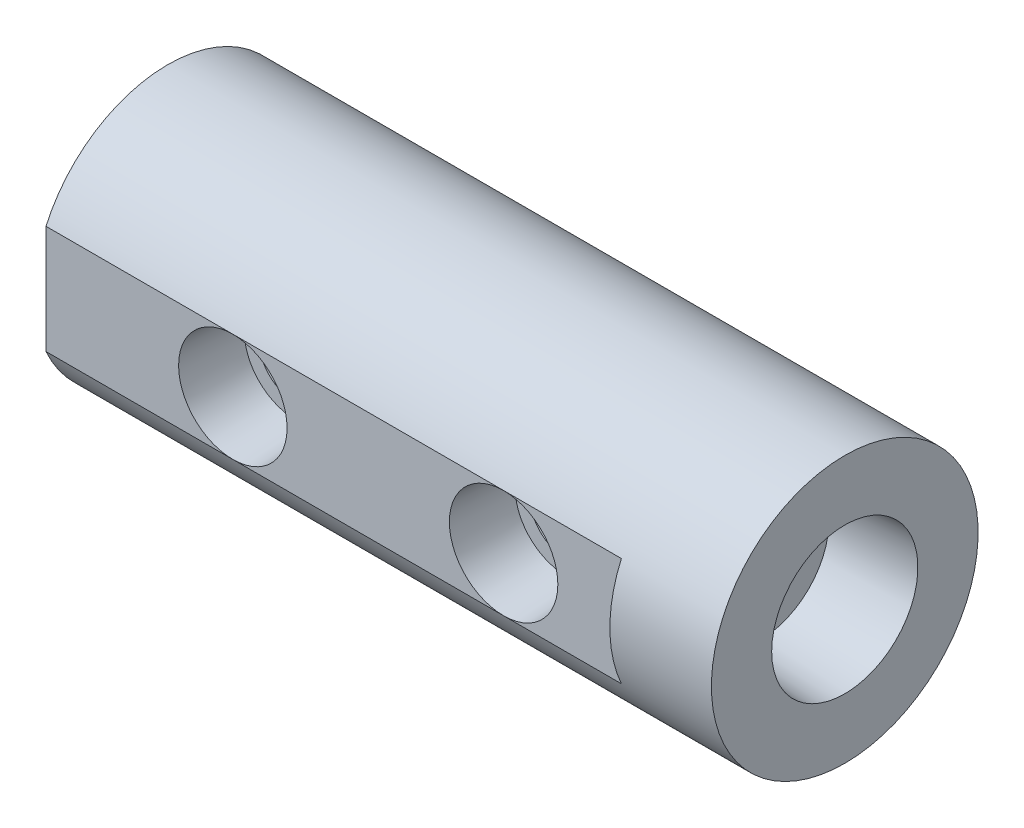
ISO-10303-21;
HEADER;
FILE_DESCRIPTION(('STEP AP214'),'2;1');
FILE_NAME('part.step','',(''),(''),'','','');
FILE_SCHEMA(('AUTOMOTIVE_DESIGN { 1 0 10303 214 1 1 1 1 }'));
ENDSEC;
DATA;
#1=APPLICATION_CONTEXT('core data for automotive mechanical design processes');
#2=APPLICATION_PROTOCOL_DEFINITION('international standard','automotive_design',2000,#1);
#3=PRODUCT_CONTEXT('',#1,'mechanical');
#4=PRODUCT('Part','Part','',(#3));
#5=PRODUCT_RELATED_PRODUCT_CATEGORY('part','',(#4));
#6=PRODUCT_DEFINITION_FORMATION('','',#4);
#7=PRODUCT_DEFINITION_CONTEXT('part definition',#1,'design');
#8=PRODUCT_DEFINITION('design','',#6,#7);
#9=PRODUCT_DEFINITION_SHAPE('','',#8);
#10=(LENGTH_UNIT() NAMED_UNIT(*) SI_UNIT(.MILLI.,.METRE.));
#11=(NAMED_UNIT(*) PLANE_ANGLE_UNIT() SI_UNIT($,.RADIAN.));
#12=(NAMED_UNIT(*) SI_UNIT($,.STERADIAN.) SOLID_ANGLE_UNIT());
#13=UNCERTAINTY_MEASURE_WITH_UNIT(LENGTH_MEASURE(1.E-05),#10,'distance_accuracy_value','');
#14=(GEOMETRIC_REPRESENTATION_CONTEXT(3) GLOBAL_UNCERTAINTY_ASSIGNED_CONTEXT((#13)) GLOBAL_UNIT_ASSIGNED_CONTEXT((#10,
#11,#12)) REPRESENTATION_CONTEXT('',''));
#15=CARTESIAN_POINT('',(0.,0.,0.));
#16=DIRECTION('',(0.,0.,1.));
#17=DIRECTION('',(1.,0.,0.));
#18=AXIS2_PLACEMENT_3D('',#15,#16,#17);
#19=CARTESIAN_POINT('',(17.526,0.,18.0848));
#20=DIRECTION('',(0.,0.,-1.));
#21=DIRECTION('',(-1.,0.,0.));
#22=AXIS2_PLACEMENT_3D('',#19,#20,#21);
#23=CYLINDRICAL_SURFACE('',#22,3.4163);
#24=CARTESIAN_POINT('',(17.526,0.,18.0848));
#25=DIRECTION('',(0.,0.,-1.));
#26=DIRECTION('',(-1.,0.,0.));
#27=AXIS2_PLACEMENT_3D('',#24,#25,#26);
#28=CIRCLE('',#27,3.4163);
#29=CARTESIAN_POINT('',(14.1097,0.,18.0848));
#30=VERTEX_POINT('',#29);
#31=EDGE_CURVE('E220',#30,#30,#28,.T.);
#32=ORIENTED_EDGE('',*,*,#31,.F.);
#33=EDGE_LOOP('',(#32));
#34=FACE_BOUND('',#33,.T.);
#35=CARTESIAN_POINT('',(17.526,0.,6.36660172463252));
#36=DIRECTION('',(0.,0.,-1.));
#37=DIRECTION('',(-1.,0.,0.));
#38=AXIS2_PLACEMENT_3D('',#35,#36,#37);
#39=CIRCLE('',#38,3.4163);
#40=CARTESIAN_POINT('',(14.1097,0.,6.36660172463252));
#41=VERTEX_POINT('',#40);
#42=EDGE_CURVE('E224',#41,#41,#39,.T.);
#43=ORIENTED_EDGE('',*,*,#42,.T.);
#44=EDGE_LOOP('',(#43));
#45=FACE_BOUND('',#44,.T.);
#46=CARTESIAN_POINT('',(20.9423,0.,15.4305));
#47=CARTESIAN_POINT('',(20.942290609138,-0.13763012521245,15.4304904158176));
#48=CARTESIAN_POINT('',(20.9339070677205,-0.275342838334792,15.4206974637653));
#49=CARTESIAN_POINT('',(20.9011248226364,-0.546180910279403,15.3822512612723));
#50=CARTESIAN_POINT('',(20.8767090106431,-0.679301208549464,15.3535778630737));
#51=CARTESIAN_POINT('',(20.8141180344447,-0.936371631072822,15.2795619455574));
#52=CARTESIAN_POINT('',(20.7760286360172,-1.06037323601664,15.2343232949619));
#53=CARTESIAN_POINT('',(20.6887053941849,-1.29786022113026,15.1295526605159));
#54=CARTESIAN_POINT('',(20.6394681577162,-1.41134238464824,15.070016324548));
#55=CARTESIAN_POINT('',(20.5123091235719,-1.66748912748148,14.9140660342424));
#56=CARTESIAN_POINT('',(20.4305827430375,-1.80495022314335,14.8122219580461));
#57=CARTESIAN_POINT('',(20.2576382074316,-2.05735949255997,14.589873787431));
#58=CARTESIAN_POINT('',(20.1663947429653,-2.17224516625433,14.4693194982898));
#59=CARTESIAN_POINT('',(20.0267919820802,-2.32855611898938,14.2750435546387));
#60=CARTESIAN_POINT('',(19.9793082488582,-2.37840870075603,14.2072902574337));
#61=CARTESIAN_POINT('',(19.8847230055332,-2.47223846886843,14.0675024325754));
#62=CARTESIAN_POINT('',(19.837621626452,-2.51621371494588,13.995466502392));
#63=CARTESIAN_POINT('',(19.7452083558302,-2.59808022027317,13.8471768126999));
#64=CARTESIAN_POINT('',(19.6998928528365,-2.63598428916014,13.7709324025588));
#65=CARTESIAN_POINT('',(19.6126669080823,-2.70555605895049,13.6138466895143));
#66=CARTESIAN_POINT('',(19.570753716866,-2.73722882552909,13.5330091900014));
#67=CARTESIAN_POINT('',(19.490291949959,-2.79558088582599,13.3613595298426));
#68=CARTESIAN_POINT('',(19.4520901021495,-2.8218528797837,13.2702401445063));
#69=CARTESIAN_POINT('',(19.3859571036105,-2.86587683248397,13.0824370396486));
#70=CARTESIAN_POINT('',(19.3580044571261,-2.88364664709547,12.9857654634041));
#71=CARTESIAN_POINT('',(19.3165231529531,-2.90960094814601,12.7863926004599));
#72=CARTESIAN_POINT('',(19.3032131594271,-2.91764029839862,12.683623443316));
#73=CARTESIAN_POINT('',(19.2949884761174,-2.92264023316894,12.4771064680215));
#74=CARTESIAN_POINT('',(19.3000564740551,-2.91961124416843,12.3733596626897));
#75=CARTESIAN_POINT('',(19.3251412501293,-2.90419341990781,12.1846802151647));
#76=CARTESIAN_POINT('',(19.3427797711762,-2.8932903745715,12.0992763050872));
#77=CARTESIAN_POINT('',(19.3876359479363,-2.86463291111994,11.9321592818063));
#78=CARTESIAN_POINT('',(19.4148699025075,-2.84686683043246,11.8504527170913));
#79=CARTESIAN_POINT('',(19.4734793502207,-2.80705729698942,11.6981209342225));
#80=CARTESIAN_POINT('',(19.5043021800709,-2.78550899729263,11.6271453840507));
#81=CARTESIAN_POINT('',(19.5698585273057,-2.73777318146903,11.4886158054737));
#82=CARTESIAN_POINT('',(19.6045950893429,-2.71158204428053,11.4210645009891));
#83=CARTESIAN_POINT('',(19.7126787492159,-2.62638732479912,11.2230068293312));
#84=CARTESIAN_POINT('',(19.7897929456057,-2.56083025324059,11.097346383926));
#85=CARTESIAN_POINT('',(19.9526457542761,-2.407498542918,10.8484151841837));
#86=CARTESIAN_POINT('',(20.0385843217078,-2.3183775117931,10.7261181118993));
#87=CARTESIAN_POINT('',(20.207185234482,-2.1211247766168,10.4955428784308));
#88=CARTESIAN_POINT('',(20.2898513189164,-2.0130155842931,10.3872483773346));
#89=CARTESIAN_POINT('',(20.4420388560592,-1.7847920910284,10.1926400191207));
#90=CARTESIAN_POINT('',(20.5120552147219,-1.66581804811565,10.1053863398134));
#91=CARTESIAN_POINT('',(20.6403703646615,-1.41139345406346,9.94775688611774));
#92=CARTESIAN_POINT('',(20.6986804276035,-1.27595895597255,9.8773648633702));
#93=CARTESIAN_POINT('',(20.7903111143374,-1.01538344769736,9.76767594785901));
#94=CARTESIAN_POINT('',(20.8262130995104,-0.892540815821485,9.72510166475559));
#95=CARTESIAN_POINT('',(20.8844633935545,-0.639271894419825,9.65630009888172));
#96=CARTESIAN_POINT('',(20.9068215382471,-0.508851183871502,9.63006095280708));
#97=CARTESIAN_POINT('',(20.9362505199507,-0.243321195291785,9.59556343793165));
#98=CARTESIAN_POINT('',(20.9432540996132,-0.108193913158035,9.587384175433));
#99=CARTESIAN_POINT('',(20.9411358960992,0.161763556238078,9.58986143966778));
#100=CARTESIAN_POINT('',(20.9320143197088,0.296593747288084,9.60051772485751));
#101=CARTESIAN_POINT('',(20.8996538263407,0.55229063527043,9.63847860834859));
#102=CARTESIAN_POINT('',(20.8774444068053,0.673475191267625,9.66456962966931));
#103=CARTESIAN_POINT('',(20.8213651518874,0.909037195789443,9.73085334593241));
#104=CARTESIAN_POINT('',(20.7874935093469,1.02341358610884,9.77104822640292));
#105=CARTESIAN_POINT('',(20.7068056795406,1.25283364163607,9.86763898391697));
#106=CARTESIAN_POINT('',(20.6591374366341,1.36711677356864,9.92511696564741));
#107=CARTESIAN_POINT('',(20.5551148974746,1.58433524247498,10.0522667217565));
#108=CARTESIAN_POINT('',(20.498753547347,1.68726124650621,10.1219484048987));
#109=CARTESIAN_POINT('',(20.3499835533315,1.93012400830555,10.3093186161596));
#110=CARTESIAN_POINT('',(20.2536806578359,2.062708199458,10.433548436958));
#111=CARTESIAN_POINT('',(20.1052534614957,2.24156498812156,10.6344802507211));
#112=CARTESIAN_POINT('',(20.0550350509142,2.29791871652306,10.7040072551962));
#113=CARTESIAN_POINT('',(19.9544492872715,2.4039715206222,10.8478336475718));
#114=CARTESIAN_POINT('',(19.9040819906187,2.45367285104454,10.9221314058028));
#115=CARTESIAN_POINT('',(19.7791856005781,2.56996413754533,11.1145643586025));
#116=CARTESIAN_POINT('',(19.7053669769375,2.63232397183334,11.2358110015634));
#117=CARTESIAN_POINT('',(19.6018017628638,2.71368799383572,11.4265039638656));
#118=CARTESIAN_POINT('',(19.5685005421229,2.73876295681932,11.491476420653));
#119=CARTESIAN_POINT('',(19.5055147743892,2.78462509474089,11.6245920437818));
#120=CARTESIAN_POINT('',(19.4758281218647,2.80541477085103,11.6927333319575));
#121=CARTESIAN_POINT('',(19.4148033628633,2.84696514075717,11.849821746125));
#122=CARTESIAN_POINT('',(19.3849129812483,2.86641514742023,11.9397062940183));
#123=CARTESIAN_POINT('',(19.3370051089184,2.89692797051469,12.1238669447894));
#124=CARTESIAN_POINT('',(19.318957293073,2.90801222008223,12.2181311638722));
#125=CARTESIAN_POINT('',(19.29790452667,2.92089706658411,12.409997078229));
#126=CARTESIAN_POINT('',(19.2950457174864,2.92260747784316,12.5076221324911));
#127=CARTESIAN_POINT('',(19.3054312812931,2.9162908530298,12.7017205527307));
#128=CARTESIAN_POINT('',(19.3186926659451,2.90825353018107,12.7981925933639));
#129=CARTESIAN_POINT('',(19.3626084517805,2.88075399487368,13.0061349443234));
#130=CARTESIAN_POINT('',(19.396245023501,2.85930518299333,13.1166786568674));
#131=CARTESIAN_POINT('',(19.4760871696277,2.80545293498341,13.3304249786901));
#132=CARTESIAN_POINT('',(19.5223371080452,2.77301073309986,13.4336000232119));
#133=CARTESIAN_POINT('',(19.6135813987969,2.70477474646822,13.6159549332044));
#134=CARTESIAN_POINT('',(19.6574862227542,2.67045479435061,13.6962576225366));
#135=CARTESIAN_POINT('',(19.7481203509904,2.5955239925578,13.8522544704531));
#136=CARTESIAN_POINT('',(19.7948513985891,2.55490923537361,13.927945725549));
#137=CARTESIAN_POINT('',(19.8895794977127,2.46754103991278,14.0750042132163));
#138=CARTESIAN_POINT('',(19.9375779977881,2.42078031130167,14.146366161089));
#139=CARTESIAN_POINT('',(20.0335659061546,2.32120724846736,14.2847472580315));
#140=CARTESIAN_POINT('',(20.0815553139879,2.26839466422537,14.3517662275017));
#141=CARTESIAN_POINT('',(20.1786206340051,2.15419924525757,14.4842537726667));
#142=CARTESIAN_POINT('',(20.2276489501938,2.09253851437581,14.5495184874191));
#143=CARTESIAN_POINT('',(20.3235068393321,1.9625457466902,14.6748656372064));
#144=CARTESIAN_POINT('',(20.370335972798,1.89421238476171,14.7349470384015));
#145=CARTESIAN_POINT('',(20.460620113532,1.75107078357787,14.8492336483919));
#146=CARTESIAN_POINT('',(20.5040836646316,1.67628003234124,14.9034538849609));
#147=CARTESIAN_POINT('',(20.5866917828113,1.5202202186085,15.0054694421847));
#148=CARTESIAN_POINT('',(20.6258369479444,1.4389520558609,15.0532656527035));
#149=CARTESIAN_POINT('',(20.7121410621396,1.23911359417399,15.1578579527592));
#150=CARTESIAN_POINT('',(20.7569501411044,1.1178193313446,15.2114960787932));
#151=CARTESIAN_POINT('',(20.8334640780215,0.865501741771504,15.3025382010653));
#152=CARTESIAN_POINT('',(20.865191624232,0.734495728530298,15.3399703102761));
#153=CARTESIAN_POINT('',(20.906590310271,0.502566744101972,15.3886732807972));
#154=CARTESIAN_POINT('',(20.9199180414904,0.403193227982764,15.4042961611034));
#155=CARTESIAN_POINT('',(20.9377769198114,0.20256155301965,15.4252137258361));
#156=CARTESIAN_POINT('',(20.9423069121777,0.10130314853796,15.4305070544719));
#157=CARTESIAN_POINT('',(20.9423,0.,15.4305));
#158=B_SPLINE_CURVE_WITH_KNOTS('',3,(#46,#47,#48,#49,#50,#51,#52,#53,#54,#55,#56,#57,#58,#59,
#60,#61,#62,#63,#64,#65,#66,#67,#68,#69,#70,#71,#72,#73,#74,#75,#76,#77,#78,#79,#80,#81,#82,#83,
#84,#85,#86,#87,#88,#89,#90,#91,#92,#93,#94,#95,#96,#97,#98,#99,#100,#101,#102,#103,#104,#105,
#106,#107,#108,#109,#110,#111,#112,#113,#114,#115,#116,#117,#118,#119,#120,#121,#122,#123,#124,
#125,#126,#127,#128,#129,#130,#131,#132,#133,#134,#135,#136,#137,#138,#139,#140,#141,#142,#143,
#144,#145,#146,#147,#148,#149,#150,#151,#152,#153,#154,#155,#156,#157),.UNSPECIFIED.,.T.,.F.,(4,
2,2,2,2,2,2,2,2,2,2,2,2,2,2,2,2,2,2,2,2,2,2,2,2,2,2,2,2,2,2,2,2,2,2,2,2,2,2,2,2,2,2,2,2,2,2,2,2,
2,2,2,2,2,2,4),(0.,0.41245800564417,0.825356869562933,1.23570987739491,1.6461879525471,
2.21196913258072,2.77929526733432,3.06886037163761,3.35852083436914,3.64756185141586,
3.93636691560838,4.24229184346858,4.54757143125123,4.85735046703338,5.16683776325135,
5.42949040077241,5.69259134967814,5.93321287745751,6.17402290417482,6.65647364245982,
7.17705207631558,7.69701744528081,8.18514797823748,8.67280622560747,9.07575731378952,
9.47841541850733,9.88283378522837,10.2872469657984,10.663440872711,11.0396931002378,
11.4477435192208,11.8561268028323,12.4694827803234,12.7771111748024,13.0846350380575,
13.5482291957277,13.7796106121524,14.010856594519,14.3000046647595,14.58840939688,
14.8795840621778,15.1710662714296,15.5216678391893,15.8735188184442,16.1663794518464,
16.459422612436,16.7528165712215,17.0462226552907,17.3527691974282,17.6593767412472,
17.9651785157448,18.2709378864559,18.6891835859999,19.1067008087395,19.4102521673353,
19.713843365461),.UNSPECIFIED.);
#159=CARTESIAN_POINT('',(20.9423,0.,15.4305));
#160=VERTEX_POINT('',#159);
#161=EDGE_CURVE('E139',#160,#160,#158,.T.);
#162=ORIENTED_EDGE('',*,*,#161,.T.);
#163=EDGE_LOOP('',(#162));
#164=FACE_BOUND('',#163,.T.);
#165=ADVANCED_FACE('F16',(#34,#45,#164),#23,.F.);
#166=CARTESIAN_POINT('',(42.926,0.,18.0848));
#167=DIRECTION('',(0.,0.,-1.));
#168=DIRECTION('',(-1.,0.,0.));
#169=AXIS2_PLACEMENT_3D('',#166,#167,#168);
#170=CYLINDRICAL_SURFACE('',#169,3.4163);
#171=CARTESIAN_POINT('',(39.5097,0.,16.7259));
#172=CARTESIAN_POINT('',(39.5096997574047,-0.0817746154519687,16.7259002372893));
#173=CARTESIAN_POINT('',(39.5126406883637,-0.163546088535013,16.7235162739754));
#174=CARTESIAN_POINT('',(39.524350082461,-0.326425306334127,16.7140372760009));
#175=CARTESIAN_POINT('',(39.533120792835,-0.407532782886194,16.7069404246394));
#176=CARTESIAN_POINT('',(39.5563500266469,-0.568490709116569,16.688186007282));
#177=CARTESIAN_POINT('',(39.5708151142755,-0.648339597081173,16.6765231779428));
#178=CARTESIAN_POINT('',(39.605183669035,-0.806112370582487,16.6489011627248));
#179=CARTESIAN_POINT('',(39.6250895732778,-0.884035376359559,16.6329400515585));
#180=CARTESIAN_POINT('',(39.6922319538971,-1.11309999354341,16.5793207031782));
#181=CARTESIAN_POINT('',(39.7470720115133,-1.26073323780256,16.5357798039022));
#182=CARTESIAN_POINT('',(39.874259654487,-1.54340564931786,16.4361392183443));
#183=CARTESIAN_POINT('',(39.9466097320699,-1.67844301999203,16.3800377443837));
#184=CARTESIAN_POINT('',(40.1346523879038,-1.98022552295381,16.2369048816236));
#185=CARTESIAN_POINT('',(40.2566191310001,-2.14125297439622,16.1459574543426));
#186=CARTESIAN_POINT('',(40.4565827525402,-2.362848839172,16.0027506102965));
#187=CARTESIAN_POINT('',(40.5262229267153,-2.43350618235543,15.9537835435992));
#188=CARTESIAN_POINT('',(40.670875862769,-2.56812530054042,15.8546051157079));
#189=CARTESIAN_POINT('',(40.7458865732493,-2.63208960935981,15.8043942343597));
#190=CARTESIAN_POINT('',(40.9023636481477,-2.75427405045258,15.702995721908));
#191=CARTESIAN_POINT('',(40.9839166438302,-2.81238093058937,15.6518057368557));
#192=CARTESIAN_POINT('',(41.1523569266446,-2.92153569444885,15.5505845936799));
#193=CARTESIAN_POINT('',(41.2392459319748,-2.97258128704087,15.5005538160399));
#194=CARTESIAN_POINT('',(41.4182052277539,-3.06722670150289,15.4034130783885));
#195=CARTESIAN_POINT('',(41.5102611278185,-3.11084595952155,15.356295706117));
#196=CARTESIAN_POINT('',(41.6998460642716,-3.19033053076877,15.2669250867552));
#197=CARTESIAN_POINT('',(41.7973703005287,-3.2262025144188,15.2246676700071));
#198=CARTESIAN_POINT('',(42.0113079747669,-3.29372459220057,15.1424824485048));
#199=CARTESIAN_POINT('',(42.1285154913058,-3.32419229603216,15.1035985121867));
#200=CARTESIAN_POINT('',(42.3690509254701,-3.37281694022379,15.0400656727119));
#201=CARTESIAN_POINT('',(42.4923627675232,-3.39100454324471,15.0153813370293));
#202=CARTESIAN_POINT('',(42.7438915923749,-3.41379380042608,14.9842648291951));
#203=CARTESIAN_POINT('',(42.8721445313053,-3.41826207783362,14.9780118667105));
#204=CARTESIAN_POINT('',(43.127765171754,-3.41273678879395,14.9856388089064));
#205=CARTESIAN_POINT('',(43.2551322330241,-3.40273367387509,14.9995320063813));
#206=CARTESIAN_POINT('',(43.5219035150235,-3.3669813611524,15.0476961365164));
#207=CARTESIAN_POINT('',(43.6605593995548,-3.33925879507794,15.0845030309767));
#208=CARTESIAN_POINT('',(43.928961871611,-3.26872449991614,15.1734541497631));
#209=CARTESIAN_POINT('',(44.0586796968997,-3.22586654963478,15.2256452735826));
#210=CARTESIAN_POINT('',(44.2787820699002,-3.13871793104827,15.3254870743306));
#211=CARTESIAN_POINT('',(44.3711719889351,-3.09720388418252,15.3712546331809));
#212=CARTESIAN_POINT('',(44.5506860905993,-3.00692538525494,15.4659686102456));
#213=CARTESIAN_POINT('',(44.6378076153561,-2.95815731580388,15.5149166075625));
#214=CARTESIAN_POINT('',(44.8069519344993,-2.85359814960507,15.6143709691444));
#215=CARTESIAN_POINT('',(44.8889683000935,-2.79779845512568,15.6648791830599));
#216=CARTESIAN_POINT('',(45.0477758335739,-2.67936213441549,15.7660493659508));
#217=CARTESIAN_POINT('',(45.1245679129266,-2.61672670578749,15.8167113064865));
#218=CARTESIAN_POINT('',(45.2752495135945,-2.48246834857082,15.9187113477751));
#219=CARTESIAN_POINT('',(45.3489577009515,-2.41061587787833,15.9700159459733));
#220=CARTESIAN_POINT('',(45.4902905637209,-2.25969219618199,16.0704040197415));
#221=CARTESIAN_POINT('',(45.557914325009,-2.18061990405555,16.1194871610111));
#222=CARTESIAN_POINT('',(45.686364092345,-2.01553980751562,16.2141802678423));
#223=CARTESIAN_POINT('',(45.7472060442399,-1.9295491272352,16.2597982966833));
#224=CARTESIAN_POINT('',(45.8615450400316,-1.75070082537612,16.346551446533));
#225=CARTESIAN_POINT('',(45.9150422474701,-1.65784335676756,16.3876866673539));
#226=CARTESIAN_POINT('',(46.0355754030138,-1.4233118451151,16.4811946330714));
#227=CARTESIAN_POINT('',(46.0982370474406,-1.27811052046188,16.5305672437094));
#228=CARTESIAN_POINT('',(46.2036333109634,-0.976572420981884,16.6142263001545));
#229=CARTESIAN_POINT('',(46.24638264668,-0.820243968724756,16.6485238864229));
#230=CARTESIAN_POINT('',(46.3095941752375,-0.499270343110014,16.6994015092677));
#231=CARTESIAN_POINT('',(46.3299252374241,-0.334582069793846,16.7158772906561));
#232=CARTESIAN_POINT('',(46.3463194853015,-0.00321482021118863,16.7291543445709));
#233=CARTESIAN_POINT('',(46.3423893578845,0.163463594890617,16.7259610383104));
#234=CARTESIAN_POINT('',(46.312071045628,0.477766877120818,16.7014370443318));
#235=CARTESIAN_POINT('',(46.2877760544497,0.625737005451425,16.6817970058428));
#236=CARTESIAN_POINT('',(46.2209083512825,0.914709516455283,16.6281100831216));
#237=CARTESIAN_POINT('',(46.1783332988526,1.0557110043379,16.5940613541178));
#238=CARTESIAN_POINT('',(46.0744880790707,1.33467816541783,16.5118542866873));
#239=CARTESIAN_POINT('',(46.0124051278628,1.47215776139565,16.463087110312));
#240=CARTESIAN_POINT('',(45.8729113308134,1.7346342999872,16.3551821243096));
#241=CARTESIAN_POINT('',(45.7954902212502,1.8596227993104,16.2960373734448));
#242=CARTESIAN_POINT('',(45.5896800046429,2.14945442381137,16.1420575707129));
#243=CARTESIAN_POINT('',(45.4540075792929,2.30702125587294,16.0431147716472));
#244=CARTESIAN_POINT('',(45.2331099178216,2.52169478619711,15.8898695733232));
#245=CARTESIAN_POINT('',(45.1564427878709,2.58973107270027,15.8378957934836));
#246=CARTESIAN_POINT('',(44.9974786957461,2.71855436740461,15.7335252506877));
#247=CARTESIAN_POINT('',(44.9151830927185,2.77934311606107,15.6811285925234));
#248=CARTESIAN_POINT('',(44.7581019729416,2.88479394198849,15.5852552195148));
#249=CARTESIAN_POINT('',(44.6840964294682,2.93050003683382,15.5416413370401));
#250=CARTESIAN_POINT('',(44.5320342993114,3.016519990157,15.4560766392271));
#251=CARTESIAN_POINT('',(44.4539762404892,3.05683186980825,15.4141264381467));
#252=CARTESIAN_POINT('',(44.2939443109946,3.13171133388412,15.3332283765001));
#253=CARTESIAN_POINT('',(44.2119815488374,3.1662940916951,15.2942727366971));
#254=CARTESIAN_POINT('',(44.0438936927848,3.2294706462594,15.220753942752));
#255=CARTESIAN_POINT('',(43.9577697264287,3.25806605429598,15.1861896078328));
#256=CARTESIAN_POINT('',(43.7559293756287,3.31606435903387,15.1141985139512));
#257=CARTESIAN_POINT('',(43.638829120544,3.34333169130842,15.0788102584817));
#258=CARTESIAN_POINT('',(43.3991029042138,3.38556036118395,15.0229180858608));
#259=CARTESIAN_POINT('',(43.2764904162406,3.4005501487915,15.0023797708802));
#260=CARTESIAN_POINT('',(43.0275838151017,3.4170778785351,14.9796902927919));
#261=CARTESIAN_POINT('',(42.9012684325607,3.41850988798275,14.9776839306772));
#262=CARTESIAN_POINT('',(42.6503713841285,3.40748502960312,14.9928723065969));
#263=CARTESIAN_POINT('',(42.525791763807,3.3950129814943,15.0100880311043));
#264=CARTESIAN_POINT('',(42.2578229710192,3.35358612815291,15.0654474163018));
#265=CARTESIAN_POINT('',(42.1156187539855,3.32184719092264,15.1070714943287));
#266=CARTESIAN_POINT('',(41.8410045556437,3.24260028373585,15.2053343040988));
#267=CARTESIAN_POINT('',(41.7086262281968,3.19504384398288,15.2620190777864));
#268=CARTESIAN_POINT('',(41.4852407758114,3.09939143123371,15.3688062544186));
#269=CARTESIAN_POINT('',(41.3920454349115,3.05428396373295,15.4171172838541));
#270=CARTESIAN_POINT('',(41.2111693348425,2.95652440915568,15.5164662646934));
#271=CARTESIAN_POINT('',(41.1234911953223,2.90386877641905,15.5675054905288));
#272=CARTESIAN_POINT('',(40.9535174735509,2.79120481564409,15.6706787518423));
#273=CARTESIAN_POINT('',(40.8712280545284,2.73118828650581,15.7228139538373));
#274=CARTESIAN_POINT('',(40.712212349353,2.60396135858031,15.8267521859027));
#275=CARTESIAN_POINT('',(40.6354851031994,2.53675220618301,15.8785552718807));
#276=CARTESIAN_POINT('',(40.4860452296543,2.39346943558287,15.9818652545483));
#277=CARTESIAN_POINT('',(40.4134736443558,2.31722141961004,16.033335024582));
#278=CARTESIAN_POINT('',(40.2748612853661,2.15726020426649,16.1334709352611));
#279=CARTESIAN_POINT('',(40.2088216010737,2.07354576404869,16.1821366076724));
#280=CARTESIAN_POINT('',(40.0840896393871,1.89897925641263,16.2753552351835));
#281=CARTESIAN_POINT('',(40.0253810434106,1.80814380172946,16.3199172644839));
#282=CARTESIAN_POINT('',(39.9160169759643,1.61956782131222,16.403815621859));
#283=CARTESIAN_POINT('',(39.8653571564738,1.52183106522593,16.4431547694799));
#284=CARTESIAN_POINT('',(39.7552969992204,1.28111631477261,16.5292870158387));
#285=CARTESIAN_POINT('',(39.6999689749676,1.13513669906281,16.5731728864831));
#286=CARTESIAN_POINT('',(39.6319647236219,0.909198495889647,16.6274379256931));
#287=CARTESIAN_POINT('',(39.6118021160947,0.83277161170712,16.6435928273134));
#288=CARTESIAN_POINT('',(39.5767120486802,0.677982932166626,16.6717760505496));
#289=CARTESIAN_POINT('',(39.5617827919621,0.599621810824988,16.6838057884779));
#290=CARTESIAN_POINT('',(39.5363892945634,0.434919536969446,16.7042971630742));
#291=CARTESIAN_POINT('',(39.5264001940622,0.348457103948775,16.712378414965));
#292=CARTESIAN_POINT('',(39.5130548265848,0.1746620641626,16.7231803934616));
#293=CARTESIAN_POINT('',(39.5097002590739,0.087329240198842,16.7258997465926));
#294=CARTESIAN_POINT('',(39.5097,0.,16.7259));
#295=B_SPLINE_CURVE_WITH_KNOTS('',3,(#171,#172,#173,#174,#175,#176,#177,#178,#179,#180,#181,
#182,#183,#184,#185,#186,#187,#188,#189,#190,#191,#192,#193,#194,#195,#196,#197,#198,#199,#200,
#201,#202,#203,#204,#205,#206,#207,#208,#209,#210,#211,#212,#213,#214,#215,#216,#217,#218,#219,
#220,#221,#222,#223,#224,#225,#226,#227,#228,#229,#230,#231,#232,#233,#234,#235,#236,#237,#238,
#239,#240,#241,#242,#243,#244,#245,#246,#247,#248,#249,#250,#251,#252,#253,#254,#255,#256,#257,
#258,#259,#260,#261,#262,#263,#264,#265,#266,#267,#268,#269,#270,#271,#272,#273,#274,#275,#276,
#277,#278,#279,#280,#281,#282,#283,#284,#285,#286,#287,#288,#289,#290,#291,#292,#293,#294),
.UNSPECIFIED.,.T.,.F.,(4,2,2,2,2,2,2,2,2,2,2,2,2,2,2,2,2,2,2,2,2,2,2,2,2,2,2,2,2,2,2,2,2,2,2,2,
2,2,2,2,2,2,2,2,2,2,2,2,2,2,2,2,2,2,2,2,2,2,2,2,2,4),(0.,0.245231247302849,0.490557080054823,
0.73616654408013,0.98188620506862,1.46971880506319,1.95762087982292,2.61839202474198,
2.95005262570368,3.28158721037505,3.61863676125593,3.95579541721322,4.2920576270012,
4.62802914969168,5.00835056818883,5.38771880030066,5.77076368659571,6.15406142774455,
6.58998602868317,7.02725355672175,7.36029153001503,7.69349614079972,8.02711219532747,
8.3606698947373,8.70531528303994,9.05001236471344,9.39388106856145,9.73774211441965,
10.2326381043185,10.7271677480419,11.2245749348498,11.721845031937,12.1734995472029,
12.6252119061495,13.0990253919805,13.5731570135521,14.2599981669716,14.6045208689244,
14.9489606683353,15.2406513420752,15.5324487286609,15.8234604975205,16.1143938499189,
16.4890473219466,16.8628301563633,17.2395311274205,17.6166437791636,18.0687353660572,
18.5222252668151,18.8645769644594,19.2070900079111,19.5499881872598,19.8928270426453,
20.2439161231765,20.5950636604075,20.9454150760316,21.2955765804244,21.77971817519,
22.0215028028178,22.2632043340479,22.5250261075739,22.7869149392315),.UNSPECIFIED.);
#296=CARTESIAN_POINT('',(39.5097,0.,16.7259));
#297=VERTEX_POINT('',#296);
#298=EDGE_CURVE('E126',#297,#297,#295,.T.);
#299=ORIENTED_EDGE('',*,*,#298,.F.);
#300=EDGE_LOOP('',(#299));
#301=FACE_BOUND('',#300,.T.);
#302=CARTESIAN_POINT('',(42.926,0.,18.0848));
#303=DIRECTION('',(0.,0.,-1.));
#304=DIRECTION('',(-1.,0.,0.));
#305=AXIS2_PLACEMENT_3D('',#302,#303,#304);
#306=CIRCLE('',#305,3.4163);
#307=CARTESIAN_POINT('',(39.5097,0.,18.0848));
#308=VERTEX_POINT('',#307);
#309=EDGE_CURVE('E233',#308,#308,#306,.T.);
#310=ORIENTED_EDGE('',*,*,#309,.F.);
#311=EDGE_LOOP('',(#310));
#312=FACE_BOUND('',#311,.T.);
#313=ADVANCED_FACE('F170',(#301,#312),#170,.F.);
#314=CARTESIAN_POINT('',(55.5752,0.,6.06682116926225));
#315=DIRECTION('',(1.,0.,0.));
#316=DIRECTION('',(0.,0.,-1.));
#317=AXIS2_PLACEMENT_3D('',#314,#315,#316);
#318=PLANE('',#317);
#319=CARTESIAN_POINT('',(55.5752,0.,12.5095));
#320=DIRECTION('',(1.,0.,0.));
#321=DIRECTION('',(0.,0.,-1.));
#322=AXIS2_PLACEMENT_3D('',#319,#320,#321);
#323=CIRCLE('',#322,4.2164);
#324=CARTESIAN_POINT('',(55.5752,0.,8.2931));
#325=VERTEX_POINT('',#324);
#326=EDGE_CURVE('E716',#325,#325,#323,.T.);
#327=ORIENTED_EDGE('',*,*,#326,.F.);
#328=EDGE_LOOP('',(#327));
#329=FACE_BOUND('',#328,.T.);
#330=CARTESIAN_POINT('',(55.5752,0.,12.5095));
#331=DIRECTION('',(-1.,0.,0.));
#332=DIRECTION('',(0.,0.,1.));
#333=AXIS2_PLACEMENT_3D('',#330,#331,#332);
#334=CIRCLE('',#333,6.44267883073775);
#335=CARTESIAN_POINT('',(55.5752,0.,18.9521788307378));
#336=VERTEX_POINT('',#335);
#337=EDGE_CURVE('E340',#336,#336,#334,.T.);
#338=ORIENTED_EDGE('',*,*,#337,.F.);
#339=EDGE_LOOP('',(#338));
#340=FACE_BOUND('',#339,.T.);
#341=ADVANCED_FACE('F166',(#329,#340),#318,.T.);
#342=CARTESIAN_POINT('',(63.5,0.,12.5095));
#343=DIRECTION('',(-1.,0.,0.));
#344=DIRECTION('',(0.,-1.,0.));
#345=AXIS2_PLACEMENT_3D('',#342,#343,#344);
#346=PLANE('',#345);
#347=CARTESIAN_POINT('',(63.5,0.,12.5095));
#348=DIRECTION('',(-1.,0.,0.));
#349=DIRECTION('',(0.,1.,0.));
#350=AXIS2_PLACEMENT_3D('',#347,#348,#349);
#351=CIRCLE('',#350,12.5095);
#352=CARTESIAN_POINT('',(63.5,12.5095,12.5095));
#353=VERTEX_POINT('',#352);
#354=EDGE_CURVE('E132',#353,#353,#351,.T.);
#355=ORIENTED_EDGE('',*,*,#354,.F.);
#356=EDGE_LOOP('',(#355));
#357=FACE_BOUND('',#356,.T.);
#358=CARTESIAN_POINT('',(63.5,0.,12.5095));
#359=DIRECTION('',(-1.,0.,0.));
#360=DIRECTION('',(0.,0.,1.));
#361=AXIS2_PLACEMENT_3D('',#358,#359,#360);
#362=CIRCLE('',#361,6.858);
#363=CARTESIAN_POINT('',(63.5,0.,19.3675));
#364=VERTEX_POINT('',#363);
#365=EDGE_CURVE('E338',#364,#364,#362,.T.);
#366=ORIENTED_EDGE('',*,*,#365,.T.);
#367=EDGE_LOOP('',(#366));
#368=FACE_BOUND('',#367,.T.);
#369=ADVANCED_FACE('F169',(#357,#368),#346,.F.);
#370=CARTESIAN_POINT('',(63.5,0.,12.5095));
#371=DIRECTION('',(-1.,0.,0.));
#372=DIRECTION('',(0.,0.,1.));
#373=AXIS2_PLACEMENT_3D('',#370,#371,#372);
#374=CYLINDRICAL_SURFACE('',#373,12.5095);
#375=DIRECTION('',(-1.,0.,0.));
#376=VECTOR('',#375,1.);
#377=CARTESIAN_POINT('',(53.975,5.08684934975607,23.938041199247));
#378=LINE('',#377,#376);
#379=CARTESIAN_POINT('',(42.926,5.08684934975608,23.938041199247));
#380=VERTEX_POINT('',#379);
#381=CARTESIAN_POINT('',(17.526,5.08684934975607,23.938041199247));
#382=VERTEX_POINT('',#381);
#383=EDGE_CURVE('E115',#380,#382,#378,.T.);
#384=ORIENTED_EDGE('',*,*,#383,.F.);
#385=CARTESIAN_POINT('',(53.975,5.08684934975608,23.938041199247));
#386=VERTEX_POINT('',#385);
#387=EDGE_CURVE('E118',#386,#380,#378,.T.);
#388=ORIENTED_EDGE('',*,*,#387,.F.);
#389=CARTESIAN_POINT('',(53.975,0.,12.5095));
#390=DIRECTION('',(-1.,0.,0.));
#391=DIRECTION('',(0.,-1.,0.));
#392=AXIS2_PLACEMENT_3D('',#389,#390,#391);
#393=CIRCLE('',#392,12.5095);
#394=CARTESIAN_POINT('',(53.975,-5.08684934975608,23.938041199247));
#395=VERTEX_POINT('',#394);
#396=EDGE_CURVE('E10',#386,#395,#393,.F.);
#397=ORIENTED_EDGE('',*,*,#396,.T.);
#398=DIRECTION('',(-1.,0.,0.));
#399=VECTOR('',#398,1.);
#400=CARTESIAN_POINT('',(53.975,-5.08684934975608,23.938041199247));
#401=LINE('',#400,#399);
#402=CARTESIAN_POINT('',(42.926,-5.08684934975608,23.938041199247));
#403=VERTEX_POINT('',#402);
#404=EDGE_CURVE('E116',#395,#403,#401,.T.);
#405=ORIENTED_EDGE('',*,*,#404,.T.);
#406=CARTESIAN_POINT('',(17.526,-5.08684934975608,23.938041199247));
#407=VERTEX_POINT('',#406);
#408=EDGE_CURVE('E367',#403,#407,#401,.T.);
#409=ORIENTED_EDGE('',*,*,#408,.T.);
#410=CARTESIAN_POINT('',(0.,-5.08684934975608,23.938041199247));
#411=VERTEX_POINT('',#410);
#412=EDGE_CURVE('E130',#407,#411,#401,.T.);
#413=ORIENTED_EDGE('',*,*,#412,.T.);
#414=CARTESIAN_POINT('',(0.,0.,12.5095));
#415=DIRECTION('',(-1.,0.,0.));
#416=DIRECTION('',(0.,1.,0.));
#417=AXIS2_PLACEMENT_3D('',#414,#415,#416);
#418=CIRCLE('',#417,12.5095);
#419=CARTESIAN_POINT('',(0.,5.08684934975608,23.938041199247));
#420=VERTEX_POINT('',#419);
#421=EDGE_CURVE('E123',#420,#411,#418,.T.);
#422=ORIENTED_EDGE('',*,*,#421,.F.);
#423=EDGE_CURVE('E106',#382,#420,#378,.T.);
#424=ORIENTED_EDGE('',*,*,#423,.F.);
#425=EDGE_LOOP('',(#384,#388,#397,#405,#409,#413,#422,#424));
#426=FACE_BOUND('',#425,.T.);
#427=ORIENTED_EDGE('',*,*,#354,.T.);
#428=EDGE_LOOP('',(#427));
#429=FACE_BOUND('',#428,.T.);
#430=ADVANCED_FACE('F18',(#426,#429),#374,.T.);
#431=CARTESIAN_POINT('',(0.,0.,12.5095));
#432=DIRECTION('',(-1.,0.,0.));
#433=DIRECTION('',(0.,-1.,0.));
#434=AXIS2_PLACEMENT_3D('',#431,#432,#433);
#435=PLANE('',#434);
#436=DIRECTION('',(0.,-1.,0.));
#437=VECTOR('',#436,1.);
#438=CARTESIAN_POINT('',(0.,5.08684934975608,23.938041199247));
#439=LINE('',#438,#437);
#440=EDGE_CURVE('E109',#420,#411,#439,.T.);
#441=ORIENTED_EDGE('',*,*,#440,.F.);
#442=ORIENTED_EDGE('',*,*,#421,.T.);
#443=EDGE_LOOP('',(#441,#442));
#444=FACE_BOUND('',#443,.T.);
#445=DIRECTION('',(0.,-0.500000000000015,-0.86602540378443));
#446=VECTOR('',#445,1.);
#447=CARTESIAN_POINT('',(0.,-3.66617420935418,18.8595));
#448=LINE('',#447,#446);
#449=CARTESIAN_POINT('',(0.,-3.66617420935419,18.8595));
#450=VERTEX_POINT('',#449);
#451=CARTESIAN_POINT('',(0.,-7.33234841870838,12.5095));
#452=VERTEX_POINT('',#451);
#453=EDGE_CURVE('E256',#450,#452,#448,.T.);
#454=ORIENTED_EDGE('',*,*,#453,.T.);
#455=DIRECTION('',(0.,0.5,-0.866025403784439));
#456=VECTOR('',#455,1.);
#457=CARTESIAN_POINT('',(0.,-7.33234841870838,12.5095));
#458=LINE('',#457,#456);
#459=CARTESIAN_POINT('',(0.,-3.66617420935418,6.15949999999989));
#460=VERTEX_POINT('',#459);
#461=EDGE_CURVE('E239',#452,#460,#458,.T.);
#462=ORIENTED_EDGE('',*,*,#461,.T.);
#463=DIRECTION('',(0.,1.,0.));
#464=VECTOR('',#463,1.);
#465=CARTESIAN_POINT('',(0.,-3.66617420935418,6.15949999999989));
#466=LINE('',#465,#464);
#467=CARTESIAN_POINT('',(0.,3.6661742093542,6.15949999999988));
#468=VERTEX_POINT('',#467);
#469=EDGE_CURVE('E240',#460,#468,#466,.T.);
#470=ORIENTED_EDGE('',*,*,#469,.T.);
#471=DIRECTION('',(0.,0.5,0.866025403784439));
#472=VECTOR('',#471,1.);
#473=CARTESIAN_POINT('',(0.,3.6661742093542,6.15949999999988));
#474=LINE('',#473,#472);
#475=CARTESIAN_POINT('',(0.,7.33234841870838,12.5095));
#476=VERTEX_POINT('',#475);
#477=EDGE_CURVE('E244',#468,#476,#474,.T.);
#478=ORIENTED_EDGE('',*,*,#477,.T.);
#479=DIRECTION('',(0.,-0.500000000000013,0.866025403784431));
#480=VECTOR('',#479,1.);
#481=CARTESIAN_POINT('',(0.,7.33234841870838,12.5095));
#482=LINE('',#481,#480);
#483=CARTESIAN_POINT('',(0.,3.6661742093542,18.8595));
#484=VERTEX_POINT('',#483);
#485=EDGE_CURVE('E248',#476,#484,#482,.T.);
#486=ORIENTED_EDGE('',*,*,#485,.T.);
#487=DIRECTION('',(0.,-1.,0.));
#488=VECTOR('',#487,1.);
#489=CARTESIAN_POINT('',(0.,3.66617420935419,18.8595));
#490=LINE('',#489,#488);
#491=EDGE_CURVE('E252',#484,#450,#490,.T.);
#492=ORIENTED_EDGE('',*,*,#491,.T.);
#493=EDGE_LOOP('',(#454,#462,#470,#478,#486,#492));
#494=FACE_BOUND('',#493,.T.);
#495=ADVANCED_FACE('F121',(#444,#494),#435,.T.);
#496=CARTESIAN_POINT('',(6.35,-7.33234841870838,12.5095));
#497=DIRECTION('',(0.,0.866025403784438,0.5));
#498=DIRECTION('',(0.,-0.5,0.866025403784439));
#499=AXIS2_PLACEMENT_3D('',#496,#497,#498);
#500=PLANE('',#499);
#501=ORIENTED_EDGE('',*,*,#461,.F.);
#502=DIRECTION('',(-1.,0.,0.));
#503=VECTOR('',#502,1.);
#504=CARTESIAN_POINT('',(6.35,-7.33234841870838,12.5095));
#505=LINE('',#504,#503);
#506=CARTESIAN_POINT('',(6.35,-7.33234841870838,12.5095));
#507=VERTEX_POINT('',#506);
#508=EDGE_CURVE('E273',#507,#452,#505,.T.);
#509=ORIENTED_EDGE('',*,*,#508,.F.);
#510=DIRECTION('',(0.,0.5,-0.866025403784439));
#511=VECTOR('',#510,1.);
#512=CARTESIAN_POINT('',(6.35,-7.33234841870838,12.5095));
#513=LINE('',#512,#511);
#514=CARTESIAN_POINT('',(6.35,-3.66617420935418,6.15949999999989));
#515=VERTEX_POINT('',#514);
#516=EDGE_CURVE('E259',#507,#515,#513,.T.);
#517=ORIENTED_EDGE('',*,*,#516,.T.);
#518=DIRECTION('',(-1.,0.,0.));
#519=VECTOR('',#518,1.);
#520=CARTESIAN_POINT('',(6.35,-3.66617420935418,6.15949999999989));
#521=LINE('',#520,#519);
#522=EDGE_CURVE('E133',#515,#460,#521,.T.);
#523=ORIENTED_EDGE('',*,*,#522,.T.);
#524=EDGE_LOOP('',(#501,#509,#517,#523));
#525=FACE_BOUND('',#524,.T.);
#526=ADVANCED_FACE('F296',(#525),#500,.T.);
#527=CARTESIAN_POINT('',(6.35,-3.66617420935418,6.15949999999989));
#528=DIRECTION('',(0.,0.,1.));
#529=DIRECTION('',(0.,-1.,0.));
#530=AXIS2_PLACEMENT_3D('',#527,#528,#529);
#531=PLANE('',#530);
#532=ORIENTED_EDGE('',*,*,#469,.F.);
#533=ORIENTED_EDGE('',*,*,#522,.F.);
#534=DIRECTION('',(0.,1.,0.));
#535=VECTOR('',#534,1.);
#536=CARTESIAN_POINT('',(6.35,-3.66617420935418,6.15949999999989));
#537=LINE('',#536,#535);
#538=CARTESIAN_POINT('',(6.35,3.6661742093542,6.15949999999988));
#539=VERTEX_POINT('',#538);
#540=EDGE_CURVE('E263',#515,#539,#537,.T.);
#541=ORIENTED_EDGE('',*,*,#540,.T.);
#542=DIRECTION('',(-1.,0.,0.));
#543=VECTOR('',#542,1.);
#544=CARTESIAN_POINT('',(6.35,3.6661742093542,6.15949999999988));
#545=LINE('',#544,#543);
#546=EDGE_CURVE('E142',#539,#468,#545,.T.);
#547=ORIENTED_EDGE('',*,*,#546,.T.);
#548=EDGE_LOOP('',(#532,#533,#541,#547));
#549=FACE_BOUND('',#548,.T.);
#550=ADVANCED_FACE('F286',(#549),#531,.T.);
#551=CARTESIAN_POINT('',(6.35,3.6661742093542,6.15949999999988));
#552=DIRECTION('',(0.,-0.866025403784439,0.5));
#553=DIRECTION('',(0.,-0.5,-0.866025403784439));
#554=AXIS2_PLACEMENT_3D('',#551,#552,#553);
#555=PLANE('',#554);
#556=ORIENTED_EDGE('',*,*,#477,.F.);
#557=ORIENTED_EDGE('',*,*,#546,.F.);
#558=DIRECTION('',(0.,0.5,0.866025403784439));
#559=VECTOR('',#558,1.);
#560=CARTESIAN_POINT('',(6.35,3.6661742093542,6.15949999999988));
#561=LINE('',#560,#559);
#562=CARTESIAN_POINT('',(6.35,7.33234841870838,12.5095));
#563=VERTEX_POINT('',#562);
#564=EDGE_CURVE('E265',#539,#563,#561,.T.);
#565=ORIENTED_EDGE('',*,*,#564,.T.);
#566=DIRECTION('',(-1.,0.,0.));
#567=VECTOR('',#566,1.);
#568=CARTESIAN_POINT('',(6.35,7.33234841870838,12.5095));
#569=LINE('',#568,#567);
#570=EDGE_CURVE('E282',#563,#476,#569,.T.);
#571=ORIENTED_EDGE('',*,*,#570,.T.);
#572=EDGE_LOOP('',(#556,#557,#565,#571));
#573=FACE_BOUND('',#572,.T.);
#574=ADVANCED_FACE('F290',(#573),#555,.T.);
#575=CARTESIAN_POINT('',(6.35,7.33234841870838,12.5095));
#576=DIRECTION('',(0.,-0.866025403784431,-0.500000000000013));
#577=DIRECTION('',(0.,0.500000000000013,-0.866025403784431));
#578=AXIS2_PLACEMENT_3D('',#575,#576,#577);
#579=PLANE('',#578);
#580=ORIENTED_EDGE('',*,*,#485,.F.);
#581=ORIENTED_EDGE('',*,*,#570,.F.);
#582=DIRECTION('',(0.,-0.500000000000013,0.866025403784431));
#583=VECTOR('',#582,1.);
#584=CARTESIAN_POINT('',(6.35,7.33234841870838,12.5095));
#585=LINE('',#584,#583);
#586=CARTESIAN_POINT('',(6.35,3.6661742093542,18.8595));
#587=VERTEX_POINT('',#586);
#588=EDGE_CURVE('E267',#563,#587,#585,.T.);
#589=ORIENTED_EDGE('',*,*,#588,.T.);
#590=DIRECTION('',(-1.,0.,0.));
#591=VECTOR('',#590,1.);
#592=CARTESIAN_POINT('',(6.35,3.6661742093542,18.8595));
#593=LINE('',#592,#591);
#594=EDGE_CURVE('E280',#587,#484,#593,.T.);
#595=ORIENTED_EDGE('',*,*,#594,.T.);
#596=EDGE_LOOP('',(#580,#581,#589,#595));
#597=FACE_BOUND('',#596,.T.);
#598=ADVANCED_FACE('F307',(#597),#579,.T.);
#599=CARTESIAN_POINT('',(6.35,3.66617420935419,18.8595));
#600=DIRECTION('',(0.,0.,-1.));
#601=DIRECTION('',(-1.,0.,0.));
#602=AXIS2_PLACEMENT_3D('',#599,#600,#601);
#603=PLANE('',#602);
#604=ORIENTED_EDGE('',*,*,#491,.F.);
#605=ORIENTED_EDGE('',*,*,#594,.F.);
#606=DIRECTION('',(0.,-1.,0.));
#607=VECTOR('',#606,1.);
#608=CARTESIAN_POINT('',(6.35,3.66617420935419,18.8595));
#609=LINE('',#608,#607);
#610=CARTESIAN_POINT('',(6.35,-3.66617420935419,18.8595));
#611=VERTEX_POINT('',#610);
#612=EDGE_CURVE('E269',#587,#611,#609,.T.);
#613=ORIENTED_EDGE('',*,*,#612,.T.);
#614=DIRECTION('',(-1.,0.,0.));
#615=VECTOR('',#614,1.);
#616=CARTESIAN_POINT('',(6.35,-3.66617420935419,18.8595));
#617=LINE('',#616,#615);
#618=EDGE_CURVE('E278',#611,#450,#617,.T.);
#619=ORIENTED_EDGE('',*,*,#618,.T.);
#620=EDGE_LOOP('',(#604,#605,#613,#619));
#621=FACE_BOUND('',#620,.T.);
#622=ADVANCED_FACE('F311',(#621),#603,.T.);
#623=CARTESIAN_POINT('',(6.35,-3.66617420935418,18.8595));
#624=DIRECTION('',(0.,0.86602540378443,-0.500000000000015));
#625=DIRECTION('',(0.,0.500000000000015,0.86602540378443));
#626=AXIS2_PLACEMENT_3D('',#623,#624,#625);
#627=PLANE('',#626);
#628=ORIENTED_EDGE('',*,*,#453,.F.);
#629=ORIENTED_EDGE('',*,*,#618,.F.);
#630=DIRECTION('',(0.,-0.500000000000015,-0.86602540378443));
#631=VECTOR('',#630,1.);
#632=CARTESIAN_POINT('',(6.35,-3.66617420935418,18.8595));
#633=LINE('',#632,#631);
#634=EDGE_CURVE('E271',#611,#507,#633,.T.);
#635=ORIENTED_EDGE('',*,*,#634,.T.);
#636=ORIENTED_EDGE('',*,*,#508,.T.);
#637=EDGE_LOOP('',(#628,#629,#635,#636));
#638=FACE_BOUND('',#637,.T.);
#639=ADVANCED_FACE('F299',(#638),#627,.T.);
#640=CARTESIAN_POINT('',(6.35,-7.33234841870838,12.5095));
#641=DIRECTION('',(-1.,0.,0.));
#642=DIRECTION('',(0.,-1.,0.));
#643=AXIS2_PLACEMENT_3D('',#640,#641,#642);
#644=PLANE('',#643);
#645=ORIENTED_EDGE('',*,*,#516,.F.);
#646=ORIENTED_EDGE('',*,*,#634,.F.);
#647=ORIENTED_EDGE('',*,*,#612,.F.);
#648=ORIENTED_EDGE('',*,*,#588,.F.);
#649=ORIENTED_EDGE('',*,*,#564,.F.);
#650=ORIENTED_EDGE('',*,*,#540,.F.);
#651=EDGE_LOOP('',(#645,#646,#647,#648,#649,#650));
#652=FACE_BOUND('',#651,.T.);
#653=ADVANCED_FACE('F304',(#652),#644,.T.);
#654=CARTESIAN_POINT('',(17.526,0.,25.019));
#655=DIRECTION('',(0.,0.,1.));
#656=DIRECTION('',(1.,0.,0.));
#657=AXIS2_PLACEMENT_3D('',#654,#655,#656);
#658=CONICAL_SURFACE('',#657,5.1435,0.0523598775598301);
#659=CARTESIAN_POINT('',(17.526,0.,23.938041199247));
#660=DIRECTION('',(0.,0.,-1.));
#661=DIRECTION('',(-1.,0.,0.));
#662=AXIS2_PLACEMENT_3D('',#659,#660,#661);
#663=CIRCLE('',#662,5.08684934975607);
#664=EDGE_CURVE('E38',#382,#407,#663,.T.);
#665=ORIENTED_EDGE('',*,*,#664,.F.);
#666=EDGE_CURVE('E112',#407,#382,#663,.T.);
#667=ORIENTED_EDGE('',*,*,#666,.F.);
#668=EDGE_LOOP('',(#665,#667));
#669=FACE_BOUND('',#668,.T.);
#670=CARTESIAN_POINT('',(17.526,0.,18.0848));
#671=DIRECTION('',(0.,0.,-1.));
#672=DIRECTION('',(-1.,0.,0.));
#673=AXIS2_PLACEMENT_3D('',#670,#671,#672);
#674=CIRCLE('',#673,4.78009397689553);
#675=CARTESIAN_POINT('',(12.7459060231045,0.,18.0848));
#676=VERTEX_POINT('',#675);
#677=EDGE_CURVE('E230',#676,#676,#674,.T.);
#678=ORIENTED_EDGE('',*,*,#677,.T.);
#679=EDGE_LOOP('',(#678));
#680=FACE_BOUND('',#679,.T.);
#681=ADVANCED_FACE('F373',(#669,#680),#658,.F.);
#682=CARTESIAN_POINT('',(22.3060939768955,0.,18.0848));
#683=DIRECTION('',(0.,0.,1.));
#684=DIRECTION('',(1.,0.,0.));
#685=AXIS2_PLACEMENT_3D('',#682,#683,#684);
#686=PLANE('',#685);
#687=ORIENTED_EDGE('',*,*,#31,.T.);
#688=EDGE_LOOP('',(#687));
#689=FACE_BOUND('',#688,.T.);
#690=ORIENTED_EDGE('',*,*,#677,.F.);
#691=EDGE_LOOP('',(#690));
#692=FACE_BOUND('',#691,.T.);
#693=ADVANCED_FACE('F363',(#689,#692),#686,.T.);
#694=CARTESIAN_POINT('',(17.526,0.,6.36660172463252));
#695=DIRECTION('',(0.,0.,1.));
#696=DIRECTION('',(1.,0.,0.));
#697=AXIS2_PLACEMENT_3D('',#694,#695,#696);
#698=CONICAL_SURFACE('',#697,3.4163,1.0471975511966);
#699=CARTESIAN_POINT('',(17.526,0.,4.3942));
#700=VERTEX_POINT('',#699);
#701=VERTEX_LOOP('',#700);
#702=FACE_BOUND('',#701,.T.);
#703=ORIENTED_EDGE('',*,*,#42,.F.);
#704=EDGE_LOOP('',(#703));
#705=FACE_BOUND('',#704,.T.);
#706=ADVANCED_FACE('F358',(#702,#705),#698,.F.);
#707=CARTESIAN_POINT('',(42.926,0.,25.019));
#708=DIRECTION('',(0.,0.,1.));
#709=DIRECTION('',(1.,0.,0.));
#710=AXIS2_PLACEMENT_3D('',#707,#708,#709);
#711=CONICAL_SURFACE('',#710,5.1435,0.0523598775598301);
#712=CARTESIAN_POINT('',(42.926,0.,23.938041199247));
#713=DIRECTION('',(0.,0.,-1.));
#714=DIRECTION('',(-1.,0.,0.));
#715=AXIS2_PLACEMENT_3D('',#712,#713,#714);
#716=CIRCLE('',#715,5.08684934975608);
#717=EDGE_CURVE('E30',#380,#403,#716,.T.);
#718=ORIENTED_EDGE('',*,*,#717,.F.);
#719=EDGE_CURVE('E152',#403,#380,#716,.T.);
#720=ORIENTED_EDGE('',*,*,#719,.F.);
#721=EDGE_LOOP('',(#718,#720));
#722=FACE_BOUND('',#721,.T.);
#723=CARTESIAN_POINT('',(42.926,0.,18.0848));
#724=DIRECTION('',(0.,0.,-1.));
#725=DIRECTION('',(-1.,0.,0.));
#726=AXIS2_PLACEMENT_3D('',#723,#724,#725);
#727=CIRCLE('',#726,4.78009397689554);
#728=CARTESIAN_POINT('',(38.1459060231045,0.,18.0848));
#729=VERTEX_POINT('',#728);
#730=EDGE_CURVE('E228',#729,#729,#727,.T.);
#731=ORIENTED_EDGE('',*,*,#730,.T.);
#732=EDGE_LOOP('',(#731));
#733=FACE_BOUND('',#732,.T.);
#734=ADVANCED_FACE('F354',(#722,#733),#711,.F.);
#735=CARTESIAN_POINT('',(47.7060939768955,0.,18.0848));
#736=DIRECTION('',(0.,0.,1.));
#737=DIRECTION('',(1.,0.,0.));
#738=AXIS2_PLACEMENT_3D('',#735,#736,#737);
#739=PLANE('',#738);
#740=ORIENTED_EDGE('',*,*,#309,.T.);
#741=EDGE_LOOP('',(#740));
#742=FACE_BOUND('',#741,.T.);
#743=ORIENTED_EDGE('',*,*,#730,.F.);
#744=EDGE_LOOP('',(#743));
#745=FACE_BOUND('',#744,.T.);
#746=ADVANCED_FACE('F174',(#742,#745),#739,.T.);
#747=CARTESIAN_POINT('',(63.5,0.,12.5095));
#748=DIRECTION('',(1.,0.,0.));
#749=DIRECTION('',(0.,0.,-1.));
#750=AXIS2_PLACEMENT_3D('',#747,#748,#749);
#751=CONICAL_SURFACE('',#750,6.858,0.0523598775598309);
#752=ORIENTED_EDGE('',*,*,#337,.T.);
#753=EDGE_LOOP('',(#752));
#754=FACE_BOUND('',#753,.T.);
#755=ORIENTED_EDGE('',*,*,#365,.F.);
#756=EDGE_LOOP('',(#755));
#757=FACE_BOUND('',#756,.T.);
#758=ADVANCED_FACE('F162',(#754,#757),#751,.F.);
#759=CARTESIAN_POINT('',(46.6400387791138,0.,12.5095));
#760=DIRECTION('',(-1.,0.,0.));
#761=DIRECTION('',(0.,0.,1.));
#762=AXIS2_PLACEMENT_3D('',#759,#760,#761);
#763=CYLINDRICAL_SURFACE('',#762,2.921);
#764=CARTESIAN_POINT('',(28.448,0.,12.5095));
#765=DIRECTION('',(1.,0.,0.));
#766=DIRECTION('',(0.,0.,-1.));
#767=AXIS2_PLACEMENT_3D('',#764,#765,#766);
#768=CIRCLE('',#767,2.921);
#769=CARTESIAN_POINT('',(28.448,0.,9.5885));
#770=VERTEX_POINT('',#769);
#771=EDGE_CURVE('E720',#770,#770,#768,.T.);
#772=ORIENTED_EDGE('',*,*,#771,.T.);
#773=EDGE_LOOP('',(#772));
#774=FACE_BOUND('',#773,.T.);
#775=ORIENTED_EDGE('',*,*,#161,.F.);
#776=EDGE_LOOP('',(#775));
#777=FACE_BOUND('',#776,.T.);
#778=ADVANCED_FACE('F156',(#774,#777),#763,.F.);
#779=CARTESIAN_POINT('',(53.975,5.08684934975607,23.938041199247));
#780=DIRECTION('',(0.,0.,-1.));
#781=DIRECTION('',(-1.,0.,0.));
#782=AXIS2_PLACEMENT_3D('',#779,#780,#781);
#783=PLANE('',#782);
#784=ORIENTED_EDGE('',*,*,#717,.T.);
#785=ORIENTED_EDGE('',*,*,#404,.F.);
#786=DIRECTION('',(0.,-1.,0.));
#787=VECTOR('',#786,1.);
#788=CARTESIAN_POINT('',(53.975,5.08684934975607,23.938041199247));
#789=LINE('',#788,#787);
#790=EDGE_CURVE('E125',#386,#395,#789,.T.);
#791=ORIENTED_EDGE('',*,*,#790,.F.);
#792=ORIENTED_EDGE('',*,*,#387,.T.);
#793=EDGE_LOOP('',(#784,#785,#791,#792));
#794=FACE_BOUND('',#793,.T.);
#795=ADVANCED_FACE('F161',(#794),#783,.F.);
#796=CARTESIAN_POINT('',(53.975,0.,23.938041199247));
#797=DIRECTION('',(-1.,0.,0.));
#798=DIRECTION('',(0.,-1.,0.));
#799=AXIS2_PLACEMENT_3D('',#796,#797,#798);
#800=PLANE('',#799);
#801=ORIENTED_EDGE('',*,*,#790,.T.);
#802=ORIENTED_EDGE('',*,*,#396,.F.);
#803=EDGE_LOOP('',(#801,#802));
#804=FACE_BOUND('',#803,.T.);
#805=ADVANCED_FACE('F204',(#804),#800,.T.);
#806=ORIENTED_EDGE('',*,*,#664,.T.);
#807=ORIENTED_EDGE('',*,*,#408,.F.);
#808=ORIENTED_EDGE('',*,*,#719,.T.);
#809=ORIENTED_EDGE('',*,*,#383,.T.);
#810=EDGE_LOOP('',(#806,#807,#808,#809));
#811=FACE_BOUND('',#810,.T.);
#812=ADVANCED_FACE('F164',(#811),#783,.F.);
#813=ORIENTED_EDGE('',*,*,#666,.T.);
#814=ORIENTED_EDGE('',*,*,#423,.T.);
#815=ORIENTED_EDGE('',*,*,#440,.T.);
#816=ORIENTED_EDGE('',*,*,#412,.F.);
#817=EDGE_LOOP('',(#813,#814,#815,#816));
#818=FACE_BOUND('',#817,.T.);
#819=ADVANCED_FACE('F108',(#818),#783,.F.);
#820=CARTESIAN_POINT('',(28.448,0.,9.5885));
#821=DIRECTION('',(-1.,0.,0.));
#822=DIRECTION('',(0.,0.,1.));
#823=AXIS2_PLACEMENT_3D('',#820,#821,#822);
#824=PLANE('',#823);
#825=ORIENTED_EDGE('',*,*,#771,.F.);
#826=EDGE_LOOP('',(#825));
#827=FACE_BOUND('',#826,.T.);
#828=CARTESIAN_POINT('',(28.448,0.,12.5095));
#829=DIRECTION('',(1.,0.,0.));
#830=DIRECTION('',(0.,0.,-1.));
#831=AXIS2_PLACEMENT_3D('',#828,#829,#830);
#832=CIRCLE('',#831,4.2164);
#833=CARTESIAN_POINT('',(28.448,0.,8.2931));
#834=VERTEX_POINT('',#833);
#835=EDGE_CURVE('E193',#834,#834,#832,.T.);
#836=ORIENTED_EDGE('',*,*,#835,.T.);
#837=EDGE_LOOP('',(#836));
#838=FACE_BOUND('',#837,.T.);
#839=ADVANCED_FACE('F199',(#827,#838),#824,.F.);
#840=CARTESIAN_POINT('',(55.5752,0.,12.5095));
#841=DIRECTION('',(1.,0.,0.));
#842=DIRECTION('',(0.,0.,-1.));
#843=AXIS2_PLACEMENT_3D('',#840,#841,#842);
#844=CYLINDRICAL_SURFACE('',#843,4.2164);
#845=ORIENTED_EDGE('',*,*,#298,.T.);
#846=EDGE_LOOP('',(#845));
#847=FACE_BOUND('',#846,.T.);
#848=CARTESIAN_POINT('',(39.5097,0.,8.2931));
#849=CARTESIAN_POINT('',(39.5096997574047,0.0817746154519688,8.29309976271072));
#850=CARTESIAN_POINT('',(39.5126406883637,0.163546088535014,8.29548372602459));
#851=CARTESIAN_POINT('',(39.524350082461,0.326425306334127,8.30496272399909));
#852=CARTESIAN_POINT('',(39.533120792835,0.407532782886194,8.31205957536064));
#853=CARTESIAN_POINT('',(39.5563500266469,0.568490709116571,8.33081399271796));
#854=CARTESIAN_POINT('',(39.5708151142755,0.648339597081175,8.34247682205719));
#855=CARTESIAN_POINT('',(39.605183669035,0.806112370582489,8.37009883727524));
#856=CARTESIAN_POINT('',(39.6250895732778,0.88403537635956,8.38605994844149));
#857=CARTESIAN_POINT('',(39.6922319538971,1.11309999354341,8.43967929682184));
#858=CARTESIAN_POINT('',(39.7470720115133,1.26073323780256,8.4832201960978));
#859=CARTESIAN_POINT('',(39.874259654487,1.54340564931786,8.58286078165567));
#860=CARTESIAN_POINT('',(39.9466097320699,1.67844301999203,8.63896225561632));
#861=CARTESIAN_POINT('',(40.1346523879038,1.98022552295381,8.78209511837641));
#862=CARTESIAN_POINT('',(40.2566191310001,2.14125297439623,8.8730425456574));
#863=CARTESIAN_POINT('',(40.4565827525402,2.36284883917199,9.0162493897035));
#864=CARTESIAN_POINT('',(40.5262229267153,2.43350618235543,9.06521645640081));
#865=CARTESIAN_POINT('',(40.670875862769,2.56812530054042,9.16439488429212));
#866=CARTESIAN_POINT('',(40.7458865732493,2.63208960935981,9.21460576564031));
#867=CARTESIAN_POINT('',(40.9023636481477,2.75427405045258,9.31600427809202));
#868=CARTESIAN_POINT('',(40.9839166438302,2.81238093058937,9.36719426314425));
#869=CARTESIAN_POINT('',(41.1523569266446,2.92153569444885,9.4684154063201));
#870=CARTESIAN_POINT('',(41.2392459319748,2.97258128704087,9.51844618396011));
#871=CARTESIAN_POINT('',(41.4182052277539,3.06722670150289,9.61558692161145));
#872=CARTESIAN_POINT('',(41.5102611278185,3.11084595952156,9.66270429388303));
#873=CARTESIAN_POINT('',(41.6998460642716,3.19033053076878,9.75207491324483));
#874=CARTESIAN_POINT('',(41.7973703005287,3.2262025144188,9.79433232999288));
#875=CARTESIAN_POINT('',(42.0113079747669,3.29372459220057,9.8765175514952));
#876=CARTESIAN_POINT('',(42.1285154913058,3.32419229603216,9.91540148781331));
#877=CARTESIAN_POINT('',(42.3690509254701,3.37281694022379,9.97893432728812));
#878=CARTESIAN_POINT('',(42.4923627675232,3.39100454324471,10.0036186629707));
#879=CARTESIAN_POINT('',(42.7438915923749,3.41379380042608,10.0347351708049));
#880=CARTESIAN_POINT('',(42.8721445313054,3.41826207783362,10.0409881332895));
#881=CARTESIAN_POINT('',(43.127765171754,3.41273678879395,10.0333611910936));
#882=CARTESIAN_POINT('',(43.2551322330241,3.40273367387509,10.0194679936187));
#883=CARTESIAN_POINT('',(43.5219035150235,3.3669813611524,9.97130386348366));
#884=CARTESIAN_POINT('',(43.6605593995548,3.33925879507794,9.93449696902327));
#885=CARTESIAN_POINT('',(43.928961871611,3.26872449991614,9.8455458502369));
#886=CARTESIAN_POINT('',(44.0586796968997,3.22586654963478,9.79335472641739));
#887=CARTESIAN_POINT('',(44.2787820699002,3.13871793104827,9.6935129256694));
#888=CARTESIAN_POINT('',(44.3711719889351,3.09720388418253,9.64774536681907));
#889=CARTESIAN_POINT('',(44.5506860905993,3.00692538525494,9.55303138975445));
#890=CARTESIAN_POINT('',(44.6378076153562,2.95815731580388,9.50408339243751));
#891=CARTESIAN_POINT('',(44.8069519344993,2.85359814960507,9.4046290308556));
#892=CARTESIAN_POINT('',(44.8889683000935,2.79779845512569,9.35412081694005));
#893=CARTESIAN_POINT('',(45.0477758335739,2.67936213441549,9.25295063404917));
#894=CARTESIAN_POINT('',(45.1245679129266,2.61672670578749,9.20228869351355));
#895=CARTESIAN_POINT('',(45.2752495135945,2.48246834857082,9.10028865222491));
#896=CARTESIAN_POINT('',(45.3489577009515,2.41061587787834,9.04898405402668));
#897=CARTESIAN_POINT('',(45.4902905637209,2.259692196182,8.94859598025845));
#898=CARTESIAN_POINT('',(45.557914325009,2.18061990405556,8.89951283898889));
#899=CARTESIAN_POINT('',(45.686364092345,2.01553980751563,8.80481973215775));
#900=CARTESIAN_POINT('',(45.7472060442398,1.92954912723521,8.75920170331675));
#901=CARTESIAN_POINT('',(45.8615450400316,1.75070082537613,8.67244855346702));
#902=CARTESIAN_POINT('',(45.9150422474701,1.65784335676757,8.63131333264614));
#903=CARTESIAN_POINT('',(46.0355754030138,1.4233118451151,8.53780536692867));
#904=CARTESIAN_POINT('',(46.0982370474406,1.27811052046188,8.48843275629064));
#905=CARTESIAN_POINT('',(46.2036333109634,0.976572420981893,8.40477369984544));
#906=CARTESIAN_POINT('',(46.24638264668,0.820243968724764,8.37047611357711));
#907=CARTESIAN_POINT('',(46.3095941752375,0.499270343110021,8.31959849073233));
#908=CARTESIAN_POINT('',(46.3299252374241,0.334582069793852,8.30312270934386));
#909=CARTESIAN_POINT('',(46.3463194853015,0.0032148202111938,8.28984565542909));
#910=CARTESIAN_POINT('',(46.3423893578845,-0.163463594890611,8.29303896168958));
#911=CARTESIAN_POINT('',(46.312071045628,-0.477766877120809,8.3175629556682));
#912=CARTESIAN_POINT('',(46.2877760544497,-0.625737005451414,8.33720299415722));
#913=CARTESIAN_POINT('',(46.2209083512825,-0.914709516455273,8.39088991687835));
#914=CARTESIAN_POINT('',(46.1783332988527,-1.0557110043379,8.42493864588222));
#915=CARTESIAN_POINT('',(46.0744880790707,-1.33467816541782,8.50714571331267));
#916=CARTESIAN_POINT('',(46.0124051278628,-1.47215776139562,8.55591288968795));
#917=CARTESIAN_POINT('',(45.8729113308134,-1.73463429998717,8.66381787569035));
#918=CARTESIAN_POINT('',(45.7954902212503,-1.8596227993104,8.72296262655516));
#919=CARTESIAN_POINT('',(45.589680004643,-2.14945442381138,8.87694242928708));
#920=CARTESIAN_POINT('',(45.4540075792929,-2.30702125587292,8.97588522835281));
#921=CARTESIAN_POINT('',(45.2331099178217,-2.52169478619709,9.12913042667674));
#922=CARTESIAN_POINT('',(45.1564427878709,-2.58973107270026,9.18110420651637));
#923=CARTESIAN_POINT('',(44.9974786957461,-2.71855436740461,9.28547474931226));
#924=CARTESIAN_POINT('',(44.9151830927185,-2.77934311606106,9.33787140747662));
#925=CARTESIAN_POINT('',(44.7581019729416,-2.88479394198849,9.43374478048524));
#926=CARTESIAN_POINT('',(44.6840964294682,-2.93050003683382,9.47735866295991));
#927=CARTESIAN_POINT('',(44.5320342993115,-3.01651999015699,9.56292336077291));
#928=CARTESIAN_POINT('',(44.4539762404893,-3.05683186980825,9.60487356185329));
#929=CARTESIAN_POINT('',(44.2939443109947,-3.13171133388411,9.68577162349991));
#930=CARTESIAN_POINT('',(44.2119815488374,-3.16629409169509,9.72472726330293));
#931=CARTESIAN_POINT('',(44.0438936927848,-3.22947064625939,9.79824605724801));
#932=CARTESIAN_POINT('',(43.9577697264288,-3.25806605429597,9.8328103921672));
#933=CARTESIAN_POINT('',(43.7559293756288,-3.31606435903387,9.90480148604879));
#934=CARTESIAN_POINT('',(43.6388291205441,-3.34333169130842,9.94018974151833));
#935=CARTESIAN_POINT('',(43.3991029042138,-3.38556036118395,9.99608191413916));
#936=CARTESIAN_POINT('',(43.2764904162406,-3.4005501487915,10.0166202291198));
#937=CARTESIAN_POINT('',(43.0275838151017,-3.4170778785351,10.0393097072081));
#938=CARTESIAN_POINT('',(42.9012684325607,-3.41850988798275,10.0413160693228));
#939=CARTESIAN_POINT('',(42.6503713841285,-3.40748502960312,10.0261276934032));
#940=CARTESIAN_POINT('',(42.525791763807,-3.3950129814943,10.0089119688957));
#941=CARTESIAN_POINT('',(42.2578229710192,-3.35358612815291,9.95355258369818));
#942=CARTESIAN_POINT('',(42.1156187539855,-3.32184719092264,9.91192850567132));
#943=CARTESIAN_POINT('',(41.8410045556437,-3.24260028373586,9.81366569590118));
#944=CARTESIAN_POINT('',(41.7086262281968,-3.19504384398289,9.75698092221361));
#945=CARTESIAN_POINT('',(41.4852407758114,-3.09939143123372,9.6501937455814));
#946=CARTESIAN_POINT('',(41.3920454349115,-3.05428396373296,9.60188271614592));
#947=CARTESIAN_POINT('',(41.2111693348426,-2.95652440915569,9.50253373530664));
#948=CARTESIAN_POINT('',(41.1234911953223,-2.90386877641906,9.45149450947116));
#949=CARTESIAN_POINT('',(40.953517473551,-2.79120481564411,9.3483212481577));
#950=CARTESIAN_POINT('',(40.8712280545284,-2.73118828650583,9.29618604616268));
#951=CARTESIAN_POINT('',(40.7122123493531,-2.60396135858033,9.19224781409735));
#952=CARTESIAN_POINT('',(40.6354851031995,-2.53675220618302,9.1404447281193));
#953=CARTESIAN_POINT('',(40.4860452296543,-2.39346943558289,9.03713474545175));
#954=CARTESIAN_POINT('',(40.4134736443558,-2.31722141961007,8.98566497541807));
#955=CARTESIAN_POINT('',(40.2748612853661,-2.15726020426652,8.88552906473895));
#956=CARTESIAN_POINT('',(40.2088216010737,-2.07354576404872,8.83686339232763));
#957=CARTESIAN_POINT('',(40.0840896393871,-1.89897925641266,8.74364476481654));
#958=CARTESIAN_POINT('',(40.0253810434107,-1.80814380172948,8.69908273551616));
#959=CARTESIAN_POINT('',(39.9160169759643,-1.61956782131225,8.61518437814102));
#960=CARTESIAN_POINT('',(39.8653571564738,-1.52183106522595,8.57584523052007));
#961=CARTESIAN_POINT('',(39.7552969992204,-1.28111631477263,8.48971298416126));
#962=CARTESIAN_POINT('',(39.6999689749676,-1.13513669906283,8.44582711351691));
#963=CARTESIAN_POINT('',(39.6319647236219,-0.909198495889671,8.3915620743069));
#964=CARTESIAN_POINT('',(39.6118021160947,-0.832771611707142,8.37540717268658));
#965=CARTESIAN_POINT('',(39.5767120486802,-0.677982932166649,8.34722394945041));
#966=CARTESIAN_POINT('',(39.5617827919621,-0.599621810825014,8.33519421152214));
#967=CARTESIAN_POINT('',(39.5363892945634,-0.43491953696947,8.31470283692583));
#968=CARTESIAN_POINT('',(39.5264001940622,-0.348457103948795,8.30662158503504));
#969=CARTESIAN_POINT('',(39.5130548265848,-0.17466206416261,8.29581960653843));
#970=CARTESIAN_POINT('',(39.5097002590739,-0.0873292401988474,8.2931002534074));
#971=CARTESIAN_POINT('',(39.5097,0.,8.2931));
#972=B_SPLINE_CURVE_WITH_KNOTS('',3,(#848,#849,#850,#851,#852,#853,#854,#855,#856,#857,#858,
#859,#860,#861,#862,#863,#864,#865,#866,#867,#868,#869,#870,#871,#872,#873,#874,#875,#876,#877,
#878,#879,#880,#881,#882,#883,#884,#885,#886,#887,#888,#889,#890,#891,#892,#893,#894,#895,#896,
#897,#898,#899,#900,#901,#902,#903,#904,#905,#906,#907,#908,#909,#910,#911,#912,#913,#914,#915,
#916,#917,#918,#919,#920,#921,#922,#923,#924,#925,#926,#927,#928,#929,#930,#931,#932,#933,#934,
#935,#936,#937,#938,#939,#940,#941,#942,#943,#944,#945,#946,#947,#948,#949,#950,#951,#952,#953,
#954,#955,#956,#957,#958,#959,#960,#961,#962,#963,#964,#965,#966,#967,#968,#969,#970,#971),
.UNSPECIFIED.,.T.,.F.,(4,2,2,2,2,2,2,2,2,2,2,2,2,2,2,2,2,2,2,2,2,2,2,2,2,2,2,2,2,2,2,2,2,2,2,2,
2,2,2,2,2,2,2,2,2,2,2,2,2,2,2,2,2,2,2,2,2,2,2,2,2,4),(0.,0.245231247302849,0.490557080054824,
0.736166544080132,0.981886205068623,1.46971880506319,1.95762087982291,2.61839202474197,
2.95005262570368,3.28158721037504,3.61863676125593,3.95579541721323,4.29205762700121,
4.62802914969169,5.00835056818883,5.38771880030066,5.77076368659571,6.15406142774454,
6.58998602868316,7.02725355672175,7.36029153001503,7.69349614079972,8.02711219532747,
8.36066989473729,8.70531528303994,9.05001236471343,9.39388106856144,9.73774211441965,
10.2326381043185,10.7271677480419,11.2245749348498,11.721845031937,12.1734995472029,
12.6252119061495,13.0990253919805,13.573157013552,14.2599981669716,14.6045208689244,
14.9489606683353,15.2406513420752,15.5324487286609,15.8234604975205,16.1143938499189,
16.4890473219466,16.8628301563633,17.2395311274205,17.6166437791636,18.0687353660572,
18.5222252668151,18.8645769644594,19.2070900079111,19.5499881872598,19.8928270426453,
20.2439161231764,20.5950636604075,20.9454150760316,21.2955765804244,21.77971817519,
22.0215028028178,22.2632043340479,22.5250261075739,22.7869149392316),.UNSPECIFIED.);
#973=CARTESIAN_POINT('',(39.5097,0.,8.2931));
#974=VERTEX_POINT('',#973);
#975=EDGE_CURVE('E20',#974,#974,#972,.T.);
#976=ORIENTED_EDGE('',*,*,#975,.T.);
#977=EDGE_LOOP('',(#976));
#978=FACE_BOUND('',#977,.T.);
#979=ORIENTED_EDGE('',*,*,#835,.F.);
#980=EDGE_LOOP('',(#979));
#981=FACE_BOUND('',#980,.T.);
#982=ORIENTED_EDGE('',*,*,#326,.T.);
#983=EDGE_LOOP('',(#982));
#984=FACE_BOUND('',#983,.T.);
#985=ADVANCED_FACE('F179',(#847,#978,#981,#984),#844,.F.);
#986=CARTESIAN_POINT('',(42.926,0.,6.36660172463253));
#987=DIRECTION('',(0.,0.,1.));
#988=DIRECTION('',(1.,0.,0.));
#989=AXIS2_PLACEMENT_3D('',#986,#987,#988);
#990=CONICAL_SURFACE('',#989,3.4163,1.0471975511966);
#991=CARTESIAN_POINT('',(42.926,0.,4.3942));
#992=VERTEX_POINT('',#991);
#993=VERTEX_LOOP('',#992);
#994=FACE_BOUND('',#993,.T.);
#995=CARTESIAN_POINT('',(42.926,0.,6.36660172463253));
#996=DIRECTION('',(0.,0.,-1.));
#997=DIRECTION('',(-1.,0.,0.));
#998=AXIS2_PLACEMENT_3D('',#995,#996,#997);
#999=CIRCLE('',#998,3.4163);
#1000=CARTESIAN_POINT('',(39.5097,0.,6.36660172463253));
#1001=VERTEX_POINT('',#1000);
#1002=EDGE_CURVE('E343',#1001,#1001,#999,.T.);
#1003=ORIENTED_EDGE('',*,*,#1002,.F.);
#1004=EDGE_LOOP('',(#1003));
#1005=FACE_BOUND('',#1004,.T.);
#1006=ADVANCED_FACE('F176',(#994,#1005),#990,.F.);
#1007=ORIENTED_EDGE('',*,*,#975,.F.);
#1008=EDGE_LOOP('',(#1007));
#1009=FACE_BOUND('',#1008,.T.);
#1010=ORIENTED_EDGE('',*,*,#1002,.T.);
#1011=EDGE_LOOP('',(#1010));
#1012=FACE_BOUND('',#1011,.T.);
#1013=ADVANCED_FACE('F178',(#1009,#1012),#170,.F.);
#1014=CLOSED_SHELL('',(#165,#313,#341,#369,#430,#495,#526,#550,#574,#598,#622,#639,#653,#681,
#693,#706,#734,#746,#758,#778,#795,#805,#812,#819,#839,#985,#1006,#1013));
#1015=MANIFOLD_SOLID_BREP('B1',#1014);
#1016=ADVANCED_BREP_SHAPE_REPRESENTATION('',(#18,#1015),#14);
#1017=SHAPE_DEFINITION_REPRESENTATION(#9,#1016);
ENDSEC;
END-ISO-10303-21;
